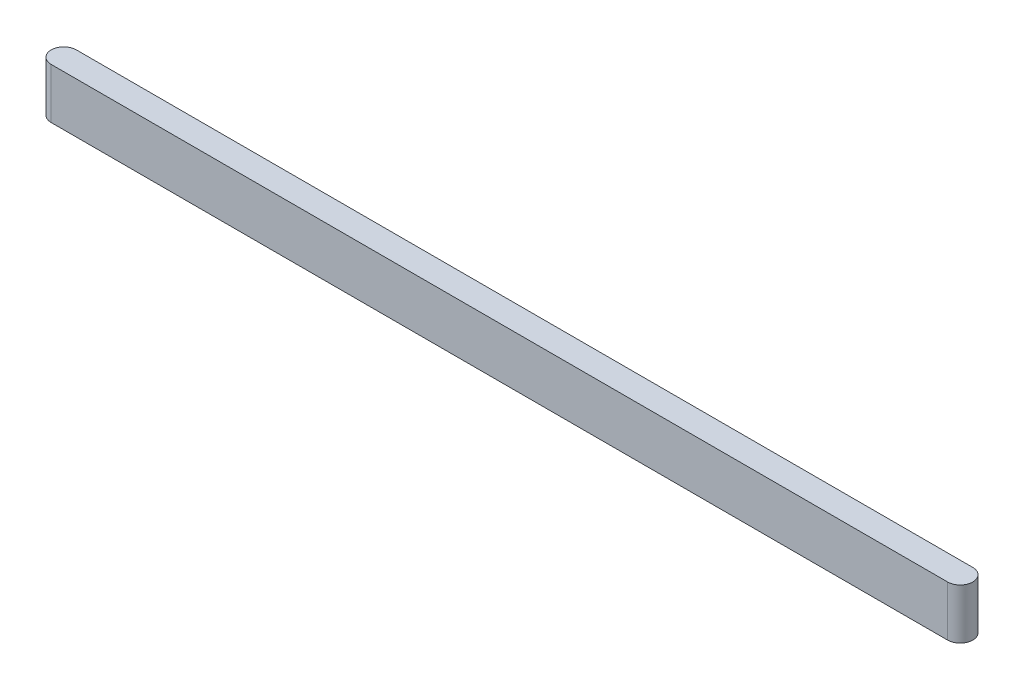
ISO-10303-21;
HEADER;
FILE_DESCRIPTION(('STEP AP214'),'2;1');
FILE_NAME('part.step','',(''),(''),'','','');
FILE_SCHEMA(('AUTOMOTIVE_DESIGN { 1 0 10303 214 1 1 1 1 }'));
ENDSEC;
DATA;
#1=APPLICATION_CONTEXT('core data for automotive mechanical design processes');
#2=APPLICATION_PROTOCOL_DEFINITION('international standard','automotive_design',2000,#1);
#3=PRODUCT_CONTEXT('',#1,'mechanical');
#4=PRODUCT('Part','Part','',(#3));
#5=PRODUCT_RELATED_PRODUCT_CATEGORY('part','',(#4));
#6=PRODUCT_DEFINITION_FORMATION('','',#4);
#7=PRODUCT_DEFINITION_CONTEXT('part definition',#1,'design');
#8=PRODUCT_DEFINITION('design','',#6,#7);
#9=PRODUCT_DEFINITION_SHAPE('','',#8);
#10=(LENGTH_UNIT() NAMED_UNIT(*) SI_UNIT(.MILLI.,.METRE.));
#11=(NAMED_UNIT(*) PLANE_ANGLE_UNIT() SI_UNIT($,.RADIAN.));
#12=(NAMED_UNIT(*) SI_UNIT($,.STERADIAN.) SOLID_ANGLE_UNIT());
#13=UNCERTAINTY_MEASURE_WITH_UNIT(LENGTH_MEASURE(1.E-05),#10,'distance_accuracy_value','');
#14=(GEOMETRIC_REPRESENTATION_CONTEXT(3) GLOBAL_UNCERTAINTY_ASSIGNED_CONTEXT((#13)) GLOBAL_UNIT_ASSIGNED_CONTEXT((#10,
#11,#12)) REPRESENTATION_CONTEXT('',''));
#15=CARTESIAN_POINT('',(0.,0.,0.));
#16=DIRECTION('',(0.,0.,1.));
#17=DIRECTION('',(1.,0.,0.));
#18=AXIS2_PLACEMENT_3D('',#15,#16,#17);
#19=CARTESIAN_POINT('',(178.,0.,5.));
#20=DIRECTION('',(0.,0.,-1.));
#21=DIRECTION('',(0.,1.,0.));
#22=AXIS2_PLACEMENT_3D('',#19,#20,#21);
#23=PLANE('',#22);
#24=DIRECTION('',(0.,-1.,0.));
#25=VECTOR('',#24,1.);
#26=CARTESIAN_POINT('',(-178.,0.,4.99999999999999));
#27=LINE('',#26,#25);
#28=CARTESIAN_POINT('',(-178.,0.,4.99999999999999));
#29=VERTEX_POINT('',#28);
#30=CARTESIAN_POINT('',(-178.,-20.,5.00000000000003));
#31=VERTEX_POINT('',#30);
#32=EDGE_CURVE('E73',#29,#31,#27,.T.);
#33=ORIENTED_EDGE('',*,*,#32,.T.);
#34=DIRECTION('',(-1.,0.,0.));
#35=VECTOR('',#34,1.);
#36=CARTESIAN_POINT('',(178.,-20.,4.99999999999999));
#37=LINE('',#36,#35);
#38=CARTESIAN_POINT('',(178.,-20.,4.99999999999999));
#39=VERTEX_POINT('',#38);
#40=EDGE_CURVE('E11',#39,#31,#37,.T.);
#41=ORIENTED_EDGE('',*,*,#40,.F.);
#42=DIRECTION('',(0.,-1.,0.));
#43=VECTOR('',#42,1.);
#44=CARTESIAN_POINT('',(178.,0.,5.));
#45=LINE('',#44,#43);
#46=CARTESIAN_POINT('',(178.,0.,4.99999999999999));
#47=VERTEX_POINT('',#46);
#48=EDGE_CURVE('E80',#47,#39,#45,.T.);
#49=ORIENTED_EDGE('',*,*,#48,.F.);
#50=DIRECTION('',(-1.,0.,0.));
#51=VECTOR('',#50,1.);
#52=CARTESIAN_POINT('',(178.,0.,5.));
#53=LINE('',#52,#51);
#54=EDGE_CURVE('E86',#47,#29,#53,.T.);
#55=ORIENTED_EDGE('',*,*,#54,.T.);
#56=EDGE_LOOP('',(#33,#41,#49,#55));
#57=FACE_BOUND('',#56,.T.);
#58=ADVANCED_FACE('F28',(#57),#23,.F.);
#59=CARTESIAN_POINT('',(178.,-20.,4.99999999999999));
#60=DIRECTION('',(0.,1.,0.));
#61=DIRECTION('',(0.,0.,1.));
#62=AXIS2_PLACEMENT_3D('',#59,#60,#61);
#63=PLANE('',#62);
#64=ORIENTED_EDGE('',*,*,#40,.T.);
#65=CARTESIAN_POINT('',(-178.,-20.,0.));
#66=DIRECTION('',(0.,1.,0.));
#67=DIRECTION('',(0.,0.,1.));
#68=AXIS2_PLACEMENT_3D('',#65,#66,#67);
#69=CIRCLE('',#68,4.99999999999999);
#70=CARTESIAN_POINT('',(-178.,-20.,-4.99999999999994));
#71=VERTEX_POINT('',#70);
#72=EDGE_CURVE('E77',#71,#31,#69,.T.);
#73=ORIENTED_EDGE('',*,*,#72,.F.);
#74=DIRECTION('',(-1.,0.,0.));
#75=VECTOR('',#74,1.);
#76=CARTESIAN_POINT('',(178.,-20.,-5.00000000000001));
#77=LINE('',#76,#75);
#78=CARTESIAN_POINT('',(178.,-20.,-5.00000000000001));
#79=VERTEX_POINT('',#78);
#80=EDGE_CURVE('E35',#79,#71,#77,.T.);
#81=ORIENTED_EDGE('',*,*,#80,.F.);
#82=CARTESIAN_POINT('',(178.,-20.,0.));
#83=DIRECTION('',(0.,1.,0.));
#84=DIRECTION('',(0.,0.,1.));
#85=AXIS2_PLACEMENT_3D('',#82,#83,#84);
#86=CIRCLE('',#85,4.99999999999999);
#87=EDGE_CURVE('E95',#39,#79,#86,.T.);
#88=ORIENTED_EDGE('',*,*,#87,.F.);
#89=EDGE_LOOP('',(#64,#73,#81,#88));
#90=FACE_BOUND('',#89,.T.);
#91=ADVANCED_FACE('F99',(#90),#63,.F.);
#92=CARTESIAN_POINT('',(178.,0.,-5.00000000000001));
#93=DIRECTION('',(0.,0.,1.));
#94=DIRECTION('',(0.,-1.,0.));
#95=AXIS2_PLACEMENT_3D('',#92,#93,#94);
#96=PLANE('',#95);
#97=DIRECTION('',(0.,1.,0.));
#98=VECTOR('',#97,1.);
#99=CARTESIAN_POINT('',(-178.,0.,-4.99999999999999));
#100=LINE('',#99,#98);
#101=CARTESIAN_POINT('',(-178.,0.,-4.99999999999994));
#102=VERTEX_POINT('',#101);
#103=EDGE_CURVE('E71',#71,#102,#100,.T.);
#104=ORIENTED_EDGE('',*,*,#103,.T.);
#105=DIRECTION('',(-1.,0.,0.));
#106=VECTOR('',#105,1.);
#107=CARTESIAN_POINT('',(178.,0.,-5.00000000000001));
#108=LINE('',#107,#106);
#109=CARTESIAN_POINT('',(178.,0.,-5.00000000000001));
#110=VERTEX_POINT('',#109);
#111=EDGE_CURVE('E42',#110,#102,#108,.T.);
#112=ORIENTED_EDGE('',*,*,#111,.F.);
#113=DIRECTION('',(0.,1.,0.));
#114=VECTOR('',#113,1.);
#115=CARTESIAN_POINT('',(178.,0.,-5.00000000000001));
#116=LINE('',#115,#114);
#117=EDGE_CURVE('E88',#79,#110,#116,.T.);
#118=ORIENTED_EDGE('',*,*,#117,.F.);
#119=ORIENTED_EDGE('',*,*,#80,.T.);
#120=EDGE_LOOP('',(#104,#112,#118,#119));
#121=FACE_BOUND('',#120,.T.);
#122=ADVANCED_FACE('F79',(#121),#96,.F.);
#123=CARTESIAN_POINT('',(178.,0.,5.));
#124=DIRECTION('',(0.,-1.,0.));
#125=DIRECTION('',(0.,0.,-1.));
#126=AXIS2_PLACEMENT_3D('',#123,#124,#125);
#127=PLANE('',#126);
#128=ORIENTED_EDGE('',*,*,#111,.T.);
#129=CARTESIAN_POINT('',(-178.,0.,0.));
#130=DIRECTION('',(0.,1.,0.));
#131=DIRECTION('',(0.,0.,1.));
#132=AXIS2_PLACEMENT_3D('',#129,#130,#131);
#133=CIRCLE('',#132,4.99999999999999);
#134=EDGE_CURVE('E69',#102,#29,#133,.T.);
#135=ORIENTED_EDGE('',*,*,#134,.T.);
#136=ORIENTED_EDGE('',*,*,#54,.F.);
#137=CARTESIAN_POINT('',(178.,0.,0.));
#138=DIRECTION('',(0.,1.,0.));
#139=DIRECTION('',(0.,0.,1.));
#140=AXIS2_PLACEMENT_3D('',#137,#138,#139);
#141=CIRCLE('',#140,4.99999999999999);
#142=EDGE_CURVE('E85',#47,#110,#141,.T.);
#143=ORIENTED_EDGE('',*,*,#142,.T.);
#144=EDGE_LOOP('',(#128,#135,#136,#143));
#145=FACE_BOUND('',#144,.T.);
#146=ADVANCED_FACE('F83',(#145),#127,.F.);
#147=CARTESIAN_POINT('',(178.,-20.,0.));
#148=DIRECTION('',(0.,1.,0.));
#149=DIRECTION('',(0.,0.,1.));
#150=AXIS2_PLACEMENT_3D('',#147,#148,#149);
#151=CYLINDRICAL_SURFACE('',#150,4.99999999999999);
#152=ORIENTED_EDGE('',*,*,#87,.T.);
#153=ORIENTED_EDGE('',*,*,#117,.T.);
#154=ORIENTED_EDGE('',*,*,#142,.F.);
#155=ORIENTED_EDGE('',*,*,#48,.T.);
#156=EDGE_LOOP('',(#152,#153,#154,#155));
#157=FACE_BOUND('',#156,.T.);
#158=ADVANCED_FACE('F102',(#157),#151,.T.);
#159=CARTESIAN_POINT('',(-178.,-20.,0.));
#160=DIRECTION('',(0.,1.,0.));
#161=DIRECTION('',(0.,0.,1.));
#162=AXIS2_PLACEMENT_3D('',#159,#160,#161);
#163=CYLINDRICAL_SURFACE('',#162,4.99999999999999);
#164=ORIENTED_EDGE('',*,*,#103,.F.);
#165=ORIENTED_EDGE('',*,*,#72,.T.);
#166=ORIENTED_EDGE('',*,*,#32,.F.);
#167=ORIENTED_EDGE('',*,*,#134,.F.);
#168=EDGE_LOOP('',(#164,#165,#166,#167));
#169=FACE_BOUND('',#168,.T.);
#170=ADVANCED_FACE('F70',(#169),#163,.T.);
#171=CLOSED_SHELL('',(#58,#91,#122,#146,#158,#170));
#172=MANIFOLD_SOLID_BREP('B2',#171);
#173=ADVANCED_BREP_SHAPE_REPRESENTATION('',(#18,#172),#14);
#174=SHAPE_DEFINITION_REPRESENTATION(#9,#173);
ENDSEC;
END-ISO-10303-21;
